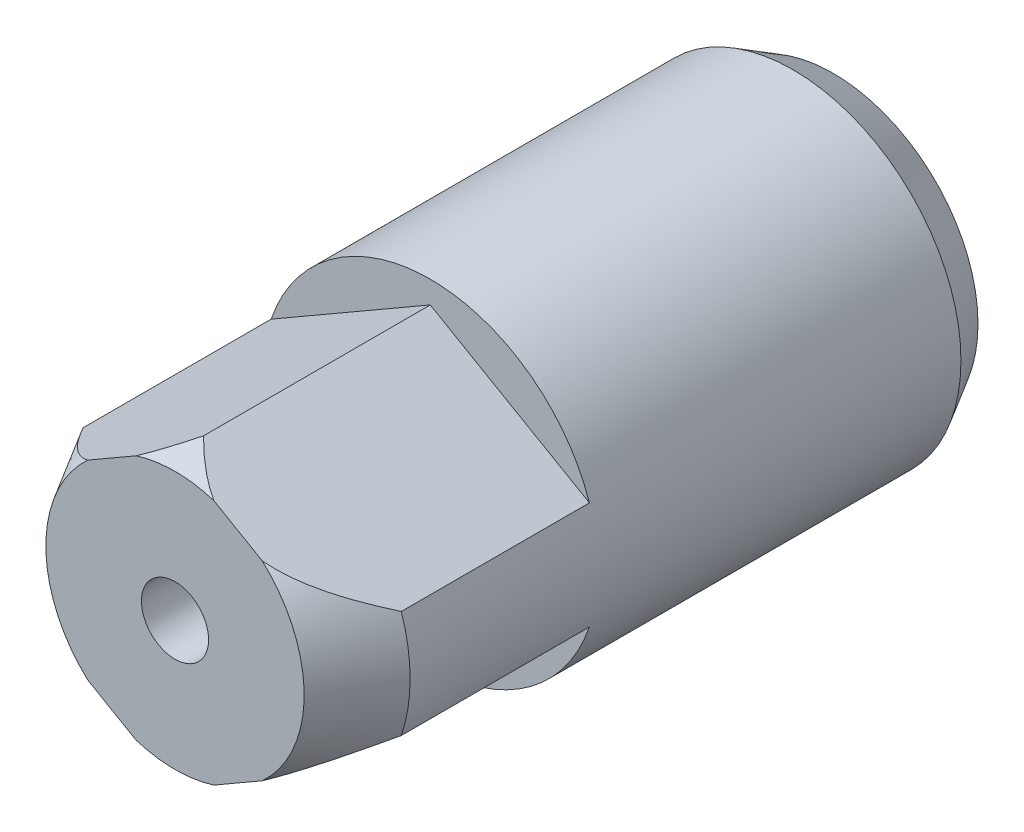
ISO-10303-21;
HEADER;
FILE_DESCRIPTION(('STEP AP214'),'2;1');
FILE_NAME('part.step','',(''),(''),'','','');
FILE_SCHEMA(('AUTOMOTIVE_DESIGN { 1 0 10303 214 1 1 1 1 }'));
ENDSEC;
DATA;
#1=APPLICATION_CONTEXT('core data for automotive mechanical design processes');
#2=APPLICATION_PROTOCOL_DEFINITION('international standard','automotive_design',2000,#1);
#3=PRODUCT_CONTEXT('',#1,'mechanical');
#4=PRODUCT('Part','Part','',(#3));
#5=PRODUCT_RELATED_PRODUCT_CATEGORY('part','',(#4));
#6=PRODUCT_DEFINITION_FORMATION('','',#4);
#7=PRODUCT_DEFINITION_CONTEXT('part definition',#1,'design');
#8=PRODUCT_DEFINITION('design','',#6,#7);
#9=PRODUCT_DEFINITION_SHAPE('','',#8);
#10=(LENGTH_UNIT() NAMED_UNIT(*) SI_UNIT(.MILLI.,.METRE.));
#11=(NAMED_UNIT(*) PLANE_ANGLE_UNIT() SI_UNIT($,.RADIAN.));
#12=(NAMED_UNIT(*) SI_UNIT($,.STERADIAN.) SOLID_ANGLE_UNIT());
#13=UNCERTAINTY_MEASURE_WITH_UNIT(LENGTH_MEASURE(1.E-05),#10,'distance_accuracy_value','');
#14=(GEOMETRIC_REPRESENTATION_CONTEXT(3) GLOBAL_UNCERTAINTY_ASSIGNED_CONTEXT((#13)) GLOBAL_UNIT_ASSIGNED_CONTEXT((#10,
#11,#12)) REPRESENTATION_CONTEXT('',''));
#15=CARTESIAN_POINT('',(0.,0.,0.));
#16=DIRECTION('',(0.,0.,1.));
#17=DIRECTION('',(1.,0.,0.));
#18=AXIS2_PLACEMENT_3D('',#15,#16,#17);
#19=CARTESIAN_POINT('',(9.61324865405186,0.,49.));
#20=DIRECTION('',(0.,0.,-1.));
#21=DIRECTION('',(-1.,0.,0.));
#22=AXIS2_PLACEMENT_3D('',#19,#20,#21);
#23=PLANE('',#22);
#24=CARTESIAN_POINT('',(0.,0.,49.));
#25=DIRECTION('',(0.,0.,1.));
#26=DIRECTION('',(1.,0.,0.));
#27=AXIS2_PLACEMENT_3D('',#24,#25,#26);
#28=CIRCLE('',#27,2.5);
#29=CARTESIAN_POINT('',(2.5,0.,49.));
#30=VERTEX_POINT('',#29);
#31=EDGE_CURVE('E9',#30,#30,#28,.T.);
#32=ORIENTED_EDGE('',*,*,#31,.F.);
#33=EDGE_LOOP('',(#32));
#34=FACE_BOUND('',#33,.T.);
#35=DIRECTION('',(-0.866025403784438,0.5,0.));
#36=VECTOR('',#35,1.);
#37=CARTESIAN_POINT('',(11.842719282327,4.,49.));
#38=LINE('',#37,#36);
#39=CARTESIAN_POINT('',(6.49432714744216,7.08789563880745,49.));
#40=VERTEX_POINT('',#39);
#41=CARTESIAN_POINT('',(2.89113410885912,9.16820010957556,49.));
#42=VERTEX_POINT('',#41);
#43=EDGE_CURVE('E113',#40,#42,#38,.T.);
#44=ORIENTED_EDGE('',*,*,#43,.T.);
#45=CARTESIAN_POINT('',(0.,0.,49.));
#46=DIRECTION('',(0.,0.,1.));
#47=DIRECTION('',(1.,0.,0.));
#48=AXIS2_PLACEMENT_3D('',#45,#46,#47);
#49=CIRCLE('',#48,9.61324865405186);
#50=CARTESIAN_POINT('',(-2.89113410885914,9.16820010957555,49.));
#51=VERTEX_POINT('',#50);
#52=EDGE_CURVE('E188',#42,#51,#49,.T.);
#53=ORIENTED_EDGE('',*,*,#52,.T.);
#54=DIRECTION('',(0.866025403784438,0.5,0.));
#55=VECTOR('',#54,1.);
#56=CARTESIAN_POINT('',(-11.842719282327,4.,49.));
#57=LINE('',#56,#55);
#58=CARTESIAN_POINT('',(-6.49432714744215,7.08789563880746,49.));
#59=VERTEX_POINT('',#58);
#60=EDGE_CURVE('E201',#59,#51,#57,.T.);
#61=ORIENTED_EDGE('',*,*,#60,.F.);
#62=CARTESIAN_POINT('',(-6.49432714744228,-7.08789563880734,49.));
#63=VERTEX_POINT('',#62);
#64=EDGE_CURVE('E185',#59,#63,#49,.T.);
#65=ORIENTED_EDGE('',*,*,#64,.T.);
#66=DIRECTION('',(0.866025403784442,-0.5,0.));
#67=VECTOR('',#66,1.);
#68=CARTESIAN_POINT('',(-11.842719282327,-4.,49.));
#69=LINE('',#68,#67);
#70=CARTESIAN_POINT('',(-2.89113410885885,-9.16820010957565,49.));
#71=VERTEX_POINT('',#70);
#72=EDGE_CURVE('E199',#63,#71,#69,.T.);
#73=ORIENTED_EDGE('',*,*,#72,.T.);
#74=CARTESIAN_POINT('',(2.89113410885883,-9.16820010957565,49.));
#75=VERTEX_POINT('',#74);
#76=EDGE_CURVE('E23',#71,#75,#49,.T.);
#77=ORIENTED_EDGE('',*,*,#76,.T.);
#78=DIRECTION('',(-0.866025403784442,-0.5,0.));
#79=VECTOR('',#78,1.);
#80=CARTESIAN_POINT('',(11.842719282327,-4.,49.));
#81=LINE('',#80,#79);
#82=CARTESIAN_POINT('',(6.49432714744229,-7.08789563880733,49.));
#83=VERTEX_POINT('',#82);
#84=EDGE_CURVE('E209',#83,#75,#81,.T.);
#85=ORIENTED_EDGE('',*,*,#84,.F.);
#86=EDGE_CURVE('E186',#83,#40,#49,.T.);
#87=ORIENTED_EDGE('',*,*,#86,.T.);
#88=EDGE_LOOP('',(#44,#53,#61,#65,#73,#77,#85,#87));
#89=FACE_BOUND('',#88,.T.);
#90=ADVANCED_FACE('F15',(#34,#89),#23,.F.);
#91=CARTESIAN_POINT('',(0.,0.,44.));
#92=DIRECTION('',(0.,0.,-1.));
#93=DIRECTION('',(-1.,0.,0.));
#94=AXIS2_PLACEMENT_3D('',#91,#92,#93);
#95=CONICAL_SURFACE('',#94,12.5,0.523598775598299);
#96=CARTESIAN_POINT('',(6.49386498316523,7.08816246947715,49.0002));
#97=CARTESIAN_POINT('',(6.60533670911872,7.02380423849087,48.9519658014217));
#98=CARTESIAN_POINT('',(6.71554975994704,6.96017270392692,48.9000110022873));
#99=CARTESIAN_POINT('',(6.93338196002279,6.83440722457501,48.7894856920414));
#100=CARTESIAN_POINT('',(7.04100270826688,6.7722723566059,48.7309193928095));
#101=CARTESIAN_POINT('',(7.35935904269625,6.58846924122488,48.5468522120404));
#102=CARTESIAN_POINT('',(7.56633463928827,6.4689718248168,48.4126495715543));
#103=CARTESIAN_POINT('',(7.9683308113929,6.23687922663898,48.1281052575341));
#104=CARTESIAN_POINT('',(8.16346186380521,6.12422026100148,47.9779679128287));
#105=CARTESIAN_POINT('',(8.54554525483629,5.90362431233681,47.6640833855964));
#106=CARTESIAN_POINT('',(8.73248971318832,5.79569187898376,47.5003235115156));
#107=CARTESIAN_POINT('',(9.18144732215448,5.53648608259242,47.0863652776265));
#108=CARTESIAN_POINT('',(9.43944719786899,5.38752978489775,46.8303903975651));
#109=CARTESIAN_POINT('',(9.94306507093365,5.09676587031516,46.3027424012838));
#110=CARTESIAN_POINT('',(10.1886801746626,4.95495992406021,46.0310656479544));
#111=CARTESIAN_POINT('',(10.5517027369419,4.74536875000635,45.6123948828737));
#112=CARTESIAN_POINT('',(10.672846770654,4.67542620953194,45.4696780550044));
#113=CARTESIAN_POINT('',(10.9127886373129,4.53689570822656,45.181627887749));
#114=CARTESIAN_POINT('',(11.0315864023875,4.46830778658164,45.0362944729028));
#115=CARTESIAN_POINT('',(11.2669028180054,4.33244779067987,44.7435624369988));
#116=CARTESIAN_POINT('',(11.3834243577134,4.26517404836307,44.5961669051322));
#117=CARTESIAN_POINT('',(11.6145403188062,4.13173918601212,44.2994009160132));
#118=CARTESIAN_POINT('',(11.7291349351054,4.06557795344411,44.150030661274));
#119=CARTESIAN_POINT('',(11.8428706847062,3.99991258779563,43.9998));
#120=B_SPLINE_CURVE_WITH_KNOTS('',3,(#96,#97,#98,#99,#100,#101,#102,#103,#104,#105,#106,#107,
#108,#109,#110,#111,#112,#113,#114,#115,#116,#117,#118,#119),.UNSPECIFIED.,.F.,.F.,(4,2,2,2,2,2,
2,2,2,2,2,4),(0.,0.412226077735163,0.82419101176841,1.64536256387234,2.45704872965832,
3.26949976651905,4.44701188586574,5.62479786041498,6.22428838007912,6.82379621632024,
7.42248587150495,8.02111459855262),.UNSPECIFIED.);
#121=CARTESIAN_POINT('',(11.842719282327,4.,44.));
#122=VERTEX_POINT('',#121);
#123=EDGE_CURVE('E245',#40,#122,#120,.T.);
#124=ORIENTED_EDGE('',*,*,#123,.F.);
#125=ORIENTED_EDGE('',*,*,#86,.F.);
#126=CARTESIAN_POINT('',(6.49386498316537,-7.08816246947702,49.0002));
#127=CARTESIAN_POINT('',(6.60533670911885,-7.02380423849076,48.9519658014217));
#128=CARTESIAN_POINT('',(6.71554975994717,-6.96017270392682,48.9000110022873));
#129=CARTESIAN_POINT('',(6.93338196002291,-6.83440722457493,48.7894856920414));
#130=CARTESIAN_POINT('',(7.04100270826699,-6.77227235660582,48.7309193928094));
#131=CARTESIAN_POINT('',(7.35935904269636,-6.5884692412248,48.5468522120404));
#132=CARTESIAN_POINT('',(7.56633463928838,-6.46897182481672,48.4126495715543));
#133=CARTESIAN_POINT('',(7.968330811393,-6.23687922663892,48.128105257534));
#134=CARTESIAN_POINT('',(8.1634618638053,-6.12422026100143,47.9779679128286));
#135=CARTESIAN_POINT('',(8.54554525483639,-5.90362431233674,47.6640833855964));
#136=CARTESIAN_POINT('',(8.73248971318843,-5.79569187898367,47.5003235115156));
#137=CARTESIAN_POINT('',(9.18144732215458,-5.53648608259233,47.0863652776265));
#138=CARTESIAN_POINT('',(9.43944719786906,-5.3875297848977,46.8303903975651));
#139=CARTESIAN_POINT('',(9.94306507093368,-5.09676587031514,46.3027424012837));
#140=CARTESIAN_POINT('',(10.1886801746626,-4.95495992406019,46.0310656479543));
#141=CARTESIAN_POINT('',(10.5517027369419,-4.74536875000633,45.6123948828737));
#142=CARTESIAN_POINT('',(10.672846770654,-4.67542620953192,45.4696780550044));
#143=CARTESIAN_POINT('',(10.9127886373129,-4.53689570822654,45.181627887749));
#144=CARTESIAN_POINT('',(11.0315864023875,-4.46830778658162,45.0362944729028));
#145=CARTESIAN_POINT('',(11.2669028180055,-4.33244779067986,44.7435624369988));
#146=CARTESIAN_POINT('',(11.3834243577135,-4.26517404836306,44.5961669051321));
#147=CARTESIAN_POINT('',(11.6145403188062,-4.13173918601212,44.2994009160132));
#148=CARTESIAN_POINT('',(11.7291349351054,-4.06557795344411,44.150030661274));
#149=CARTESIAN_POINT('',(11.8428706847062,-3.99991258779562,43.9998));
#150=B_SPLINE_CURVE_WITH_KNOTS('',3,(#126,#127,#128,#129,#130,#131,#132,#133,#134,#135,#136,
#137,#138,#139,#140,#141,#142,#143,#144,#145,#146,#147,#148,#149),.UNSPECIFIED.,.F.,.F.,(4,2,2,
2,2,2,2,2,2,2,2,4),(0.,0.412226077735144,0.824191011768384,1.64536256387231,2.45704872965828,
3.269499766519,4.44701188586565,5.62479786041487,6.224288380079,6.82379621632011,
7.4224858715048,8.02111459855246),.UNSPECIFIED.);
#151=CARTESIAN_POINT('',(11.842719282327,-4.,44.));
#152=VERTEX_POINT('',#151);
#153=EDGE_CURVE('E233',#83,#152,#150,.T.);
#154=ORIENTED_EDGE('',*,*,#153,.T.);
#155=CARTESIAN_POINT('',(0.,0.,44.));
#156=DIRECTION('',(0.,0.,1.));
#157=DIRECTION('',(1.,0.,0.));
#158=AXIS2_PLACEMENT_3D('',#155,#156,#157);
#159=CIRCLE('',#158,12.5);
#160=EDGE_CURVE('E183',#152,#122,#159,.T.);
#161=ORIENTED_EDGE('',*,*,#160,.T.);
#162=EDGE_LOOP('',(#124,#125,#154,#161));
#163=FACE_BOUND('',#162,.T.);
#164=ADVANCED_FACE('F242',(#163),#95,.T.);
#165=CARTESIAN_POINT('',(-0.000200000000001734,10.8375126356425,46.879512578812));
#166=CARTESIAN_POINT('',(0.108530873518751,10.7747368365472,46.9882268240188));
#167=CARTESIAN_POINT('',(0.218469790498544,10.7112635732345,47.0953542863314));
#168=CARTESIAN_POINT('',(0.441035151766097,10.5827654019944,47.3058908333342));
#169=CARTESIAN_POINT('',(0.553662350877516,10.5177400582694,47.4092988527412));
#170=CARTESIAN_POINT('',(0.78094274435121,10.3865196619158,47.6110158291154));
#171=CARTESIAN_POINT('',(0.895573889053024,10.3203373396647,47.7093577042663));
#172=CARTESIAN_POINT('',(1.12790669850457,10.1861999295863,47.9010504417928));
#173=CARTESIAN_POINT('',(1.24560839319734,10.1182448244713,47.9944012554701));
#174=CARTESIAN_POINT('',(1.60419684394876,9.9112136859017,48.2661456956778));
#175=CARTESIAN_POINT('',(1.85018375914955,9.7691930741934,48.4358843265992));
#176=CARTESIAN_POINT('',(2.23101578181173,9.54931960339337,48.6670579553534));
#177=CARTESIAN_POINT('',(2.36044638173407,9.47459281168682,48.7404422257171));
#178=CARTESIAN_POINT('',(2.62315549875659,9.32291763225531,48.8777749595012));
#179=CARTESIAN_POINT('',(2.75643779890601,9.24596706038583,48.941713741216));
#180=CARTESIAN_POINT('',(2.89159627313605,9.16793327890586,49.0002));
#181=B_SPLINE_CURVE_WITH_KNOTS('',3,(#165,#166,#167,#168,#169,#170,#171,#172,#173,#174,#175,
#176,#177,#178,#179,#180),.UNSPECIFIED.,.F.,.F.,(4,2,2,2,2,2,2,4),(0.,0.498243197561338,
0.996627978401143,1.49120549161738,1.98578782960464,2.97663541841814,3.47584274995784,
3.97555827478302),.UNSPECIFIED.);
#182=CARTESIAN_POINT('',(0.,10.8373971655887,46.8797125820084));
#183=VERTEX_POINT('',#182);
#184=EDGE_CURVE('E251',#183,#42,#181,.T.);
#185=ORIENTED_EDGE('',*,*,#184,.F.);
#186=CARTESIAN_POINT('',(0.000199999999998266,10.8375126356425,46.879512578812));
#187=CARTESIAN_POINT('',(-0.108530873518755,10.7747368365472,46.9882268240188));
#188=CARTESIAN_POINT('',(-0.218469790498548,10.7112635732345,47.0953542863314));
#189=CARTESIAN_POINT('',(-0.4410351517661,10.5827654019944,47.3058908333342));
#190=CARTESIAN_POINT('',(-0.553662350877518,10.5177400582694,47.4092988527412));
#191=CARTESIAN_POINT('',(-0.78094274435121,10.3865196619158,47.6110158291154));
#192=CARTESIAN_POINT('',(-0.895573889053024,10.3203373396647,47.7093577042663));
#193=CARTESIAN_POINT('',(-1.12790669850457,10.1861999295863,47.9010504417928));
#194=CARTESIAN_POINT('',(-1.24560839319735,10.1182448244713,47.9944012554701));
#195=CARTESIAN_POINT('',(-1.60419684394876,9.91121368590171,48.2661456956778));
#196=CARTESIAN_POINT('',(-1.85018375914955,9.7691930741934,48.4358843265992));
#197=CARTESIAN_POINT('',(-2.23101578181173,9.54931960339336,48.6670579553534));
#198=CARTESIAN_POINT('',(-2.36044638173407,9.47459281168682,48.7404422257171));
#199=CARTESIAN_POINT('',(-2.6231554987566,9.3229176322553,48.8777749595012));
#200=CARTESIAN_POINT('',(-2.75643779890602,9.24596706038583,48.941713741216));
#201=CARTESIAN_POINT('',(-2.89159627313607,9.16793327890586,49.0002));
#202=B_SPLINE_CURVE_WITH_KNOTS('',3,(#186,#187,#188,#189,#190,#191,#192,#193,#194,#195,#196,
#197,#198,#199,#200,#201),.UNSPECIFIED.,.F.,.F.,(4,2,2,2,2,2,2,4),(0.,0.49824319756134,
0.996627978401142,1.49120549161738,1.98578782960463,2.97663541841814,3.47584274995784,
3.97555827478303),.UNSPECIFIED.);
#203=EDGE_CURVE('E99',#183,#51,#202,.T.);
#204=ORIENTED_EDGE('',*,*,#203,.T.);
#205=ORIENTED_EDGE('',*,*,#52,.F.);
#206=EDGE_LOOP('',(#185,#204,#205));
#207=FACE_BOUND('',#206,.T.);
#208=ADVANCED_FACE('F259',(#207),#95,.T.);
#209=CARTESIAN_POINT('',(0.,0.,30.));
#210=DIRECTION('',(0.,0.,1.));
#211=DIRECTION('',(1.,0.,0.));
#212=AXIS2_PLACEMENT_3D('',#209,#210,#211);
#213=CYLINDRICAL_SURFACE('',#212,12.5);
#214=CARTESIAN_POINT('',(0.,0.,3.));
#215=DIRECTION('',(0.,0.,1.));
#216=DIRECTION('',(1.,0.,0.));
#217=AXIS2_PLACEMENT_3D('',#214,#215,#216);
#218=CIRCLE('',#217,12.5);
#219=CARTESIAN_POINT('',(12.5,0.,3.));
#220=VERTEX_POINT('',#219);
#221=EDGE_CURVE('E179',#220,#220,#218,.T.);
#222=ORIENTED_EDGE('',*,*,#221,.T.);
#223=EDGE_LOOP('',(#222));
#224=FACE_BOUND('',#223,.T.);
#225=DIRECTION('',(0.,0.,1.));
#226=VECTOR('',#225,1.);
#227=CARTESIAN_POINT('',(11.842719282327,4.,30.));
#228=LINE('',#227,#226);
#229=CARTESIAN_POINT('',(11.842719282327,4.,30.));
#230=VERTEX_POINT('',#229);
#231=EDGE_CURVE('E106',#230,#122,#228,.T.);
#232=ORIENTED_EDGE('',*,*,#231,.T.);
#233=ORIENTED_EDGE('',*,*,#160,.F.);
#234=DIRECTION('',(0.,0.,1.));
#235=VECTOR('',#234,1.);
#236=CARTESIAN_POINT('',(11.842719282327,-4.,30.));
#237=LINE('',#236,#235);
#238=CARTESIAN_POINT('',(11.842719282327,-4.,30.));
#239=VERTEX_POINT('',#238);
#240=EDGE_CURVE('E217',#239,#152,#237,.T.);
#241=ORIENTED_EDGE('',*,*,#240,.F.);
#242=CARTESIAN_POINT('',(0.,0.,30.));
#243=DIRECTION('',(0.,0.,1.));
#244=DIRECTION('',(1.,0.,0.));
#245=AXIS2_PLACEMENT_3D('',#242,#243,#244);
#246=CIRCLE('',#245,12.5);
#247=CARTESIAN_POINT('',(-11.842719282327,-4.,30.));
#248=VERTEX_POINT('',#247);
#249=EDGE_CURVE('E208',#248,#239,#246,.T.);
#250=ORIENTED_EDGE('',*,*,#249,.F.);
#251=DIRECTION('',(0.,0.,1.));
#252=VECTOR('',#251,1.);
#253=CARTESIAN_POINT('',(-11.842719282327,-4.,30.));
#254=LINE('',#253,#252);
#255=CARTESIAN_POINT('',(-11.842719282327,-4.,44.));
#256=VERTEX_POINT('',#255);
#257=EDGE_CURVE('E215',#248,#256,#254,.T.);
#258=ORIENTED_EDGE('',*,*,#257,.T.);
#259=CARTESIAN_POINT('',(-11.842719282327,4.,44.));
#260=VERTEX_POINT('',#259);
#261=EDGE_CURVE('E182',#260,#256,#159,.T.);
#262=ORIENTED_EDGE('',*,*,#261,.F.);
#263=DIRECTION('',(0.,0.,1.));
#264=VECTOR('',#263,1.);
#265=CARTESIAN_POINT('',(-11.842719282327,4.,30.));
#266=LINE('',#265,#264);
#267=CARTESIAN_POINT('',(-11.842719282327,4.,30.));
#268=VERTEX_POINT('',#267);
#269=EDGE_CURVE('E102',#268,#260,#266,.T.);
#270=ORIENTED_EDGE('',*,*,#269,.F.);
#271=CARTESIAN_POINT('',(0.,0.,30.));
#272=DIRECTION('',(0.,0.,1.));
#273=DIRECTION('',(1.,0.,0.));
#274=AXIS2_PLACEMENT_3D('',#271,#272,#273);
#275=CIRCLE('',#274,12.5);
#276=EDGE_CURVE('E110',#230,#268,#275,.T.);
#277=ORIENTED_EDGE('',*,*,#276,.F.);
#278=EDGE_LOOP('',(#232,#233,#241,#250,#258,#262,#270,#277));
#279=FACE_BOUND('',#278,.T.);
#280=ADVANCED_FACE('F213',(#224,#279),#213,.T.);
#281=ORIENTED_EDGE('',*,*,#64,.F.);
#282=CARTESIAN_POINT('',(-6.49386498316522,7.08816246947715,49.0002));
#283=CARTESIAN_POINT('',(-6.60533670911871,7.02380423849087,48.9519658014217));
#284=CARTESIAN_POINT('',(-6.71554975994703,6.96017270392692,48.9000110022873));
#285=CARTESIAN_POINT('',(-6.93338196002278,6.83440722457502,48.7894856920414));
#286=CARTESIAN_POINT('',(-7.04100270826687,6.77227235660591,48.7309193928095));
#287=CARTESIAN_POINT('',(-7.35935904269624,6.58846924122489,48.5468522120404));
#288=CARTESIAN_POINT('',(-7.56633463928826,6.4689718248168,48.4126495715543));
#289=CARTESIAN_POINT('',(-7.9683308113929,6.23687922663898,48.1281052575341));
#290=CARTESIAN_POINT('',(-8.16346186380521,6.12422026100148,47.9779679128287));
#291=CARTESIAN_POINT('',(-8.54554525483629,5.90362431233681,47.6640833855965));
#292=CARTESIAN_POINT('',(-8.73248971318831,5.79569187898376,47.5003235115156));
#293=CARTESIAN_POINT('',(-9.18144732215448,5.53648608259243,47.0863652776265));
#294=CARTESIAN_POINT('',(-9.43944719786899,5.38752978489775,46.8303903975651));
#295=CARTESIAN_POINT('',(-9.94306507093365,5.09676587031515,46.3027424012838));
#296=CARTESIAN_POINT('',(-10.1886801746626,4.95495992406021,46.0310656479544));
#297=CARTESIAN_POINT('',(-10.5517027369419,4.74536875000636,45.6123948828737));
#298=CARTESIAN_POINT('',(-10.672846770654,4.67542620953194,45.4696780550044));
#299=CARTESIAN_POINT('',(-10.9127886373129,4.53689570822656,45.181627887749));
#300=CARTESIAN_POINT('',(-11.0315864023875,4.46830778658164,45.0362944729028));
#301=CARTESIAN_POINT('',(-11.2669028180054,4.33244779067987,44.7435624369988));
#302=CARTESIAN_POINT('',(-11.3834243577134,4.26517404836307,44.5961669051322));
#303=CARTESIAN_POINT('',(-11.6145403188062,4.13173918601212,44.2994009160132));
#304=CARTESIAN_POINT('',(-11.7291349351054,4.06557795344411,44.150030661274));
#305=CARTESIAN_POINT('',(-11.8428706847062,3.99991258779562,43.9998));
#306=B_SPLINE_CURVE_WITH_KNOTS('',3,(#282,#283,#284,#285,#286,#287,#288,#289,#290,#291,#292,
#293,#294,#295,#296,#297,#298,#299,#300,#301,#302,#303,#304,#305),.UNSPECIFIED.,.F.,.F.,(4,2,2,
2,2,2,2,2,2,2,2,4),(0.,0.412226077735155,0.824191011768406,1.64536256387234,2.45704872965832,
3.26949976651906,4.44701188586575,5.62479786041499,6.22428838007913,6.82379621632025,
7.42248587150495,8.02111459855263),.UNSPECIFIED.);
#307=EDGE_CURVE('E126',#59,#260,#306,.T.);
#308=ORIENTED_EDGE('',*,*,#307,.T.);
#309=ORIENTED_EDGE('',*,*,#261,.T.);
#310=CARTESIAN_POINT('',(-6.49386498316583,-7.08816246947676,49.0002));
#311=CARTESIAN_POINT('',(-6.60533670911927,-7.02380423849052,48.9519658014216));
#312=CARTESIAN_POINT('',(-6.71554975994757,-6.9601727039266,48.9000110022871));
#313=CARTESIAN_POINT('',(-6.9333819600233,-6.83440722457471,48.7894856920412));
#314=CARTESIAN_POINT('',(-7.04100270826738,-6.7722723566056,48.7309193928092));
#315=CARTESIAN_POINT('',(-7.35935904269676,-6.58846924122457,48.5468522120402));
#316=CARTESIAN_POINT('',(-7.56633463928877,-6.46897182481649,48.412649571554));
#317=CARTESIAN_POINT('',(-7.9683308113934,-6.23687922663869,48.1281052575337));
#318=CARTESIAN_POINT('',(-8.1634618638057,-6.12422026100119,47.9779679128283));
#319=CARTESIAN_POINT('',(-8.54554525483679,-5.90362431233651,47.664083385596));
#320=CARTESIAN_POINT('',(-8.73248971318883,-5.79569187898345,47.5003235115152));
#321=CARTESIAN_POINT('',(-9.18144732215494,-5.53648608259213,47.0863652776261));
#322=CARTESIAN_POINT('',(-9.4394471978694,-5.38752978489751,46.8303903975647));
#323=CARTESIAN_POINT('',(-9.94306507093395,-5.09676587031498,46.3027424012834));
#324=CARTESIAN_POINT('',(-10.1886801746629,-4.95495992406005,46.0310656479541));
#325=CARTESIAN_POINT('',(-10.5517027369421,-4.74536875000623,45.6123948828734));
#326=CARTESIAN_POINT('',(-10.6728467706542,-4.67542620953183,45.4696780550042));
#327=CARTESIAN_POINT('',(-10.9127886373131,-4.53689570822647,45.1816278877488));
#328=CARTESIAN_POINT('',(-11.0315864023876,-4.46830778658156,45.0362944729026));
#329=CARTESIAN_POINT('',(-11.2669028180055,-4.33244779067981,44.7435624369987));
#330=CARTESIAN_POINT('',(-11.3834243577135,-4.26517404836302,44.5961669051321));
#331=CARTESIAN_POINT('',(-11.6145403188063,-4.1317391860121,44.2994009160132));
#332=CARTESIAN_POINT('',(-11.7291349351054,-4.0655779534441,44.150030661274));
#333=CARTESIAN_POINT('',(-11.8428706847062,-3.99991258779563,43.9998));
#334=B_SPLINE_CURVE_WITH_KNOTS('',3,(#310,#311,#312,#313,#314,#315,#316,#317,#318,#319,#320,
#321,#322,#323,#324,#325,#326,#327,#328,#329,#330,#331,#332,#333),.UNSPECIFIED.,.F.,.F.,(4,2,2,
2,2,2,2,2,2,2,2,4),(0.,0.412226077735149,0.824191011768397,1.64536256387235,2.45704872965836,
3.26949976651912,4.44701188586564,5.62479786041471,6.22428838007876,6.82379621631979,
7.42248587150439,8.02111459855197),.UNSPECIFIED.);
#335=EDGE_CURVE('E163',#63,#256,#334,.T.);
#336=ORIENTED_EDGE('',*,*,#335,.F.);
#337=EDGE_LOOP('',(#281,#308,#309,#336));
#338=FACE_BOUND('',#337,.T.);
#339=ADVANCED_FACE('F132',(#338),#95,.T.);
#340=CARTESIAN_POINT('',(0.000199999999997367,-10.8375126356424,46.8795125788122));
#341=CARTESIAN_POINT('',(-0.108530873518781,-10.7747368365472,46.9882268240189));
#342=CARTESIAN_POINT('',(-0.218469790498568,-10.7112635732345,47.0953542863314));
#343=CARTESIAN_POINT('',(-0.441035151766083,-10.5827654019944,47.3058908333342));
#344=CARTESIAN_POINT('',(-0.553662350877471,-10.5177400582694,47.4092988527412));
#345=CARTESIAN_POINT('',(-0.780942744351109,-10.3865196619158,47.6110158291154));
#346=CARTESIAN_POINT('',(-0.8955738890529,-10.3203373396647,47.7093577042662));
#347=CARTESIAN_POINT('',(-1.12790669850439,-10.1861999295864,47.9010504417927));
#348=CARTESIAN_POINT('',(-1.24560839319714,-10.1182448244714,47.99440125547));
#349=CARTESIAN_POINT('',(-1.60419684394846,-9.91121368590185,48.2661456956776));
#350=CARTESIAN_POINT('',(-1.85018375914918,-9.76919307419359,48.435884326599));
#351=CARTESIAN_POINT('',(-2.23101578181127,-9.54931960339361,48.6670579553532));
#352=CARTESIAN_POINT('',(-2.36044638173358,-9.47459281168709,48.7404422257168));
#353=CARTESIAN_POINT('',(-2.623155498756,-9.32291763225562,48.877774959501));
#354=CARTESIAN_POINT('',(-2.75643779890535,-9.24596706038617,48.9417137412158));
#355=CARTESIAN_POINT('',(-2.89159627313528,-9.16793327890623,49.0002));
#356=B_SPLINE_CURVE_WITH_KNOTS('',3,(#340,#341,#342,#343,#344,#345,#346,#347,#348,#349,#350,
#351,#352,#353,#354,#355),.UNSPECIFIED.,.F.,.F.,(4,2,2,2,2,2,2,4),(0.,0.498243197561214,
0.996627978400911,1.49120549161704,1.98578782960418,2.97663541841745,3.47584274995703,
3.97555827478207),.UNSPECIFIED.);
#357=CARTESIAN_POINT('',(0.,-10.8373971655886,46.8797125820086));
#358=VERTEX_POINT('',#357);
#359=EDGE_CURVE('E156',#358,#71,#356,.T.);
#360=ORIENTED_EDGE('',*,*,#359,.F.);
#361=CARTESIAN_POINT('',(-0.000200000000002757,-10.8375126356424,46.8795125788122));
#362=CARTESIAN_POINT('',(0.108530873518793,-10.7747368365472,46.9882268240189));
#363=CARTESIAN_POINT('',(0.218469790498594,-10.7112635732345,47.0953542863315));
#364=CARTESIAN_POINT('',(0.441035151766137,-10.5827654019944,47.3058908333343));
#365=CARTESIAN_POINT('',(0.553662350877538,-10.5177400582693,47.4092988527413));
#366=CARTESIAN_POINT('',(0.780942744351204,-10.3865196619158,47.6110158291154));
#367=CARTESIAN_POINT('',(0.89557388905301,-10.3203373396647,47.7093577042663));
#368=CARTESIAN_POINT('',(1.12790669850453,-10.1861999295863,47.9010504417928));
#369=CARTESIAN_POINT('',(1.24560839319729,-10.1182448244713,47.9944012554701));
#370=CARTESIAN_POINT('',(1.60419684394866,-9.91121368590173,48.2661456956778));
#371=CARTESIAN_POINT('',(1.85018375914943,-9.76919307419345,48.4358843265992));
#372=CARTESIAN_POINT('',(2.23101578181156,-9.54931960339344,48.6670579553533));
#373=CARTESIAN_POINT('',(2.3604463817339,-9.4745928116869,48.740442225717));
#374=CARTESIAN_POINT('',(2.62315549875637,-9.3229176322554,48.8777749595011));
#375=CARTESIAN_POINT('',(2.75643779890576,-9.24596706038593,48.9417137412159));
#376=CARTESIAN_POINT('',(2.89159627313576,-9.16793327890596,49.0002));
#377=B_SPLINE_CURVE_WITH_KNOTS('',3,(#361,#362,#363,#364,#365,#366,#367,#368,#369,#370,#371,
#372,#373,#374,#375,#376),.UNSPECIFIED.,.F.,.F.,(4,2,2,2,2,2,2,4),(0.,0.498243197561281,
0.996627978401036,1.49120549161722,1.98578782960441,2.97663541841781,3.47584274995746,
3.97555827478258),.UNSPECIFIED.);
#378=EDGE_CURVE('E227',#358,#75,#377,.T.);
#379=ORIENTED_EDGE('',*,*,#378,.T.);
#380=ORIENTED_EDGE('',*,*,#76,.F.);
#381=EDGE_LOOP('',(#360,#379,#380));
#382=FACE_BOUND('',#381,.T.);
#383=ADVANCED_FACE('F261',(#382),#95,.T.);
#384=CARTESIAN_POINT('',(0.,0.,30.));
#385=DIRECTION('',(0.,0.,1.));
#386=DIRECTION('',(1.,0.,0.));
#387=AXIS2_PLACEMENT_3D('',#384,#385,#386);
#388=CYLINDRICAL_SURFACE('',#387,2.5);
#389=CARTESIAN_POINT('',(0.,0.,39.));
#390=DIRECTION('',(0.,0.,1.));
#391=DIRECTION('',(1.,0.,0.));
#392=AXIS2_PLACEMENT_3D('',#389,#390,#391);
#393=CIRCLE('',#392,2.5);
#394=CARTESIAN_POINT('',(2.5,0.,39.));
#395=VERTEX_POINT('',#394);
#396=EDGE_CURVE('E287',#395,#395,#393,.T.);
#397=ORIENTED_EDGE('',*,*,#396,.F.);
#398=EDGE_LOOP('',(#397));
#399=FACE_BOUND('',#398,.T.);
#400=ORIENTED_EDGE('',*,*,#31,.T.);
#401=EDGE_LOOP('',(#400));
#402=FACE_BOUND('',#401,.T.);
#403=ADVANCED_FACE('F17',(#399,#402),#388,.F.);
#404=CARTESIAN_POINT('',(0.,0.,0.));
#405=DIRECTION('',(0.,0.,1.));
#406=DIRECTION('',(1.,0.,0.));
#407=AXIS2_PLACEMENT_3D('',#404,#405,#406);
#408=CONICAL_SURFACE('',#407,10.7679491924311,0.523598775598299);
#409=ORIENTED_EDGE('',*,*,#221,.F.);
#410=EDGE_LOOP('',(#409));
#411=FACE_BOUND('',#410,.T.);
#412=CARTESIAN_POINT('',(0.,0.,0.));
#413=DIRECTION('',(0.,0.,1.));
#414=DIRECTION('',(1.,0.,0.));
#415=AXIS2_PLACEMENT_3D('',#412,#413,#414);
#416=CIRCLE('',#415,10.7679491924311);
#417=CARTESIAN_POINT('',(10.7679491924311,0.,0.));
#418=VERTEX_POINT('',#417);
#419=EDGE_CURVE('E176',#418,#418,#416,.T.);
#420=ORIENTED_EDGE('',*,*,#419,.T.);
#421=EDGE_LOOP('',(#420));
#422=FACE_BOUND('',#421,.T.);
#423=ADVANCED_FACE('F277',(#411,#422),#408,.T.);
#424=CARTESIAN_POINT('',(1.,0.,0.));
#425=DIRECTION('',(0.,0.,1.));
#426=DIRECTION('',(1.,0.,0.));
#427=AXIS2_PLACEMENT_3D('',#424,#425,#426);
#428=PLANE('',#427);
#429=ORIENTED_EDGE('',*,*,#419,.F.);
#430=EDGE_LOOP('',(#429));
#431=FACE_BOUND('',#430,.T.);
#432=CARTESIAN_POINT('',(0.,0.,0.));
#433=DIRECTION('',(0.,0.,1.));
#434=DIRECTION('',(1.,0.,0.));
#435=AXIS2_PLACEMENT_3D('',#432,#433,#434);
#436=CIRCLE('',#435,1.);
#437=CARTESIAN_POINT('',(1.,0.,0.));
#438=VERTEX_POINT('',#437);
#439=EDGE_CURVE('E173',#438,#438,#436,.T.);
#440=ORIENTED_EDGE('',*,*,#439,.T.);
#441=EDGE_LOOP('',(#440));
#442=FACE_BOUND('',#441,.T.);
#443=ADVANCED_FACE('F282',(#431,#442),#428,.F.);
#444=CARTESIAN_POINT('',(0.,0.,30.));
#445=DIRECTION('',(0.,0.,1.));
#446=DIRECTION('',(1.,0.,0.));
#447=AXIS2_PLACEMENT_3D('',#444,#445,#446);
#448=CYLINDRICAL_SURFACE('',#447,1.);
#449=ORIENTED_EDGE('',*,*,#439,.F.);
#450=EDGE_LOOP('',(#449));
#451=FACE_BOUND('',#450,.T.);
#452=CARTESIAN_POINT('',(0.,0.,4.));
#453=DIRECTION('',(0.,0.,1.));
#454=DIRECTION('',(1.,0.,0.));
#455=AXIS2_PLACEMENT_3D('',#452,#453,#454);
#456=CIRCLE('',#455,1.);
#457=CARTESIAN_POINT('',(1.,0.,4.));
#458=VERTEX_POINT('',#457);
#459=EDGE_CURVE('E170',#458,#458,#456,.T.);
#460=ORIENTED_EDGE('',*,*,#459,.T.);
#461=EDGE_LOOP('',(#460));
#462=FACE_BOUND('',#461,.T.);
#463=ADVANCED_FACE('F334',(#451,#462),#448,.F.);
#464=CARTESIAN_POINT('',(0.,0.,4.));
#465=DIRECTION('',(0.,0.,1.));
#466=DIRECTION('',(1.,0.,0.));
#467=AXIS2_PLACEMENT_3D('',#464,#465,#466);
#468=PLANE('',#467);
#469=ORIENTED_EDGE('',*,*,#459,.F.);
#470=EDGE_LOOP('',(#469));
#471=FACE_BOUND('',#470,.T.);
#472=ADVANCED_FACE('F150',(#471),#468,.F.);
#473=CARTESIAN_POINT('',(-11.842719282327,-4.,30.));
#474=DIRECTION('',(-0.5,-0.866025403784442,0.));
#475=DIRECTION('',(0.866025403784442,-0.5,0.));
#476=AXIS2_PLACEMENT_3D('',#473,#474,#475);
#477=PLANE('',#476);
#478=ORIENTED_EDGE('',*,*,#335,.T.);
#479=ORIENTED_EDGE('',*,*,#257,.F.);
#480=DIRECTION('',(0.866025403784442,-0.5,0.));
#481=VECTOR('',#480,1.);
#482=CARTESIAN_POINT('',(-11.842719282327,-4.,30.));
#483=LINE('',#482,#481);
#484=CARTESIAN_POINT('',(0.,-10.8373971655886,30.));
#485=VERTEX_POINT('',#484);
#486=EDGE_CURVE('E38',#248,#485,#483,.T.);
#487=ORIENTED_EDGE('',*,*,#486,.T.);
#488=DIRECTION('',(0.,0.,1.));
#489=VECTOR('',#488,1.);
#490=CARTESIAN_POINT('',(0.,-10.8373971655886,30.));
#491=LINE('',#490,#489);
#492=EDGE_CURVE('E219',#485,#358,#491,.T.);
#493=ORIENTED_EDGE('',*,*,#492,.T.);
#494=ORIENTED_EDGE('',*,*,#359,.T.);
#495=ORIENTED_EDGE('',*,*,#72,.F.);
#496=EDGE_LOOP('',(#478,#479,#487,#493,#494,#495));
#497=FACE_BOUND('',#496,.T.);
#498=ADVANCED_FACE('F146',(#497),#477,.T.);
#499=CARTESIAN_POINT('',(11.842719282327,-4.,30.));
#500=DIRECTION('',(-0.5,0.866025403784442,0.));
#501=DIRECTION('',(-0.866025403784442,-0.5,0.));
#502=AXIS2_PLACEMENT_3D('',#499,#500,#501);
#503=PLANE('',#502);
#504=ORIENTED_EDGE('',*,*,#84,.T.);
#505=ORIENTED_EDGE('',*,*,#378,.F.);
#506=ORIENTED_EDGE('',*,*,#492,.F.);
#507=DIRECTION('',(-0.866025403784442,-0.5,0.));
#508=VECTOR('',#507,1.);
#509=CARTESIAN_POINT('',(11.842719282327,-4.,30.));
#510=LINE('',#509,#508);
#511=EDGE_CURVE('E221',#239,#485,#510,.T.);
#512=ORIENTED_EDGE('',*,*,#511,.F.);
#513=ORIENTED_EDGE('',*,*,#240,.T.);
#514=ORIENTED_EDGE('',*,*,#153,.F.);
#515=EDGE_LOOP('',(#504,#505,#506,#512,#513,#514));
#516=FACE_BOUND('',#515,.T.);
#517=ADVANCED_FACE('F145',(#516),#503,.F.);
#518=CARTESIAN_POINT('',(0.,0.,30.));
#519=DIRECTION('',(0.,0.,1.));
#520=DIRECTION('',(1.,0.,0.));
#521=AXIS2_PLACEMENT_3D('',#518,#519,#520);
#522=PLANE('',#521);
#523=ORIENTED_EDGE('',*,*,#486,.F.);
#524=ORIENTED_EDGE('',*,*,#249,.T.);
#525=ORIENTED_EDGE('',*,*,#511,.T.);
#526=EDGE_LOOP('',(#523,#524,#525));
#527=FACE_BOUND('',#526,.T.);
#528=ADVANCED_FACE('F141',(#527),#522,.T.);
#529=CARTESIAN_POINT('',(11.842719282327,4.,30.));
#530=DIRECTION('',(0.5,0.866025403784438,0.));
#531=DIRECTION('',(-0.866025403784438,0.5,0.));
#532=AXIS2_PLACEMENT_3D('',#529,#530,#531);
#533=PLANE('',#532);
#534=ORIENTED_EDGE('',*,*,#123,.T.);
#535=ORIENTED_EDGE('',*,*,#231,.F.);
#536=DIRECTION('',(-0.866025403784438,0.5,0.));
#537=VECTOR('',#536,1.);
#538=CARTESIAN_POINT('',(11.842719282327,4.,30.));
#539=LINE('',#538,#537);
#540=CARTESIAN_POINT('',(0.,10.8373971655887,30.));
#541=VERTEX_POINT('',#540);
#542=EDGE_CURVE('E30',#230,#541,#539,.T.);
#543=ORIENTED_EDGE('',*,*,#542,.T.);
#544=DIRECTION('',(0.,0.,1.));
#545=VECTOR('',#544,1.);
#546=CARTESIAN_POINT('',(0.,10.8373971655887,30.));
#547=LINE('',#546,#545);
#548=EDGE_CURVE('E95',#541,#183,#547,.T.);
#549=ORIENTED_EDGE('',*,*,#548,.T.);
#550=ORIENTED_EDGE('',*,*,#184,.T.);
#551=ORIENTED_EDGE('',*,*,#43,.F.);
#552=EDGE_LOOP('',(#534,#535,#543,#549,#550,#551));
#553=FACE_BOUND('',#552,.T.);
#554=ADVANCED_FACE('F104',(#553),#533,.T.);
#555=CARTESIAN_POINT('',(-11.842719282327,4.,30.));
#556=DIRECTION('',(0.5,-0.866025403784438,0.));
#557=DIRECTION('',(0.866025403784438,0.5,0.));
#558=AXIS2_PLACEMENT_3D('',#555,#556,#557);
#559=PLANE('',#558);
#560=ORIENTED_EDGE('',*,*,#60,.T.);
#561=ORIENTED_EDGE('',*,*,#203,.F.);
#562=ORIENTED_EDGE('',*,*,#548,.F.);
#563=DIRECTION('',(0.866025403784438,0.5,0.));
#564=VECTOR('',#563,1.);
#565=CARTESIAN_POINT('',(-11.842719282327,4.,30.));
#566=LINE('',#565,#564);
#567=EDGE_CURVE('E97',#268,#541,#566,.T.);
#568=ORIENTED_EDGE('',*,*,#567,.F.);
#569=ORIENTED_EDGE('',*,*,#269,.T.);
#570=ORIENTED_EDGE('',*,*,#307,.F.);
#571=EDGE_LOOP('',(#560,#561,#562,#568,#569,#570));
#572=FACE_BOUND('',#571,.T.);
#573=ADVANCED_FACE('F96',(#572),#559,.F.);
#574=CARTESIAN_POINT('',(0.,0.,30.));
#575=DIRECTION('',(0.,0.,1.));
#576=DIRECTION('',(1.,0.,0.));
#577=AXIS2_PLACEMENT_3D('',#574,#575,#576);
#578=PLANE('',#577);
#579=ORIENTED_EDGE('',*,*,#542,.F.);
#580=ORIENTED_EDGE('',*,*,#276,.T.);
#581=ORIENTED_EDGE('',*,*,#567,.T.);
#582=EDGE_LOOP('',(#579,#580,#581));
#583=FACE_BOUND('',#582,.T.);
#584=ADVANCED_FACE('F109',(#583),#578,.T.);
#585=CARTESIAN_POINT('',(0.,0.,39.));
#586=DIRECTION('',(0.,0.,1.));
#587=DIRECTION('',(1.,0.,0.));
#588=AXIS2_PLACEMENT_3D('',#585,#586,#587);
#589=PLANE('',#588);
#590=ORIENTED_EDGE('',*,*,#396,.T.);
#591=EDGE_LOOP('',(#590));
#592=FACE_BOUND('',#591,.T.);
#593=ADVANCED_FACE('F290',(#592),#589,.T.);
#594=CLOSED_SHELL('',(#90,#164,#208,#280,#339,#383,#403,#423,#443,#463,#472,#498,#517,#528,#554,
#573,#584,#593));
#595=MANIFOLD_SOLID_BREP('B1',#594);
#596=ADVANCED_BREP_SHAPE_REPRESENTATION('',(#18,#595),#14);
#597=SHAPE_DEFINITION_REPRESENTATION(#9,#596);
ENDSEC;
END-ISO-10303-21;
